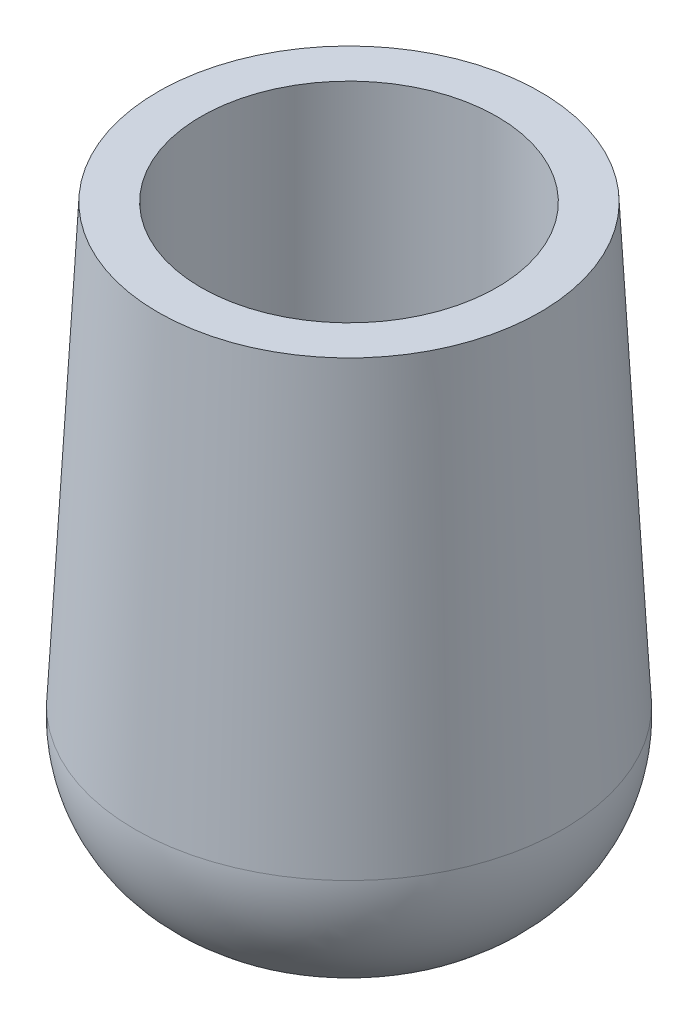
ISO-10303-21;
HEADER;
FILE_DESCRIPTION(('STEP AP214'),'2;1');
FILE_NAME('part.step','',(''),(''),'','','');
FILE_SCHEMA(('AUTOMOTIVE_DESIGN { 1 0 10303 214 1 1 1 1 }'));
ENDSEC;
DATA;
#1=APPLICATION_CONTEXT('core data for automotive mechanical design processes');
#2=APPLICATION_PROTOCOL_DEFINITION('international standard','automotive_design',2000,#1);
#3=PRODUCT_CONTEXT('',#1,'mechanical');
#4=PRODUCT('Part','Part','',(#3));
#5=PRODUCT_RELATED_PRODUCT_CATEGORY('part','',(#4));
#6=PRODUCT_DEFINITION_FORMATION('','',#4);
#7=PRODUCT_DEFINITION_CONTEXT('part definition',#1,'design');
#8=PRODUCT_DEFINITION('design','',#6,#7);
#9=PRODUCT_DEFINITION_SHAPE('','',#8);
#10=(LENGTH_UNIT() NAMED_UNIT(*) SI_UNIT(.MILLI.,.METRE.));
#11=(NAMED_UNIT(*) PLANE_ANGLE_UNIT() SI_UNIT($,.RADIAN.));
#12=(NAMED_UNIT(*) SI_UNIT($,.STERADIAN.) SOLID_ANGLE_UNIT());
#13=UNCERTAINTY_MEASURE_WITH_UNIT(LENGTH_MEASURE(1.E-05),#10,'distance_accuracy_value','');
#14=(GEOMETRIC_REPRESENTATION_CONTEXT(3) GLOBAL_UNCERTAINTY_ASSIGNED_CONTEXT((#13)) GLOBAL_UNIT_ASSIGNED_CONTEXT((#10,
#11,#12)) REPRESENTATION_CONTEXT('',''));
#15=CARTESIAN_POINT('',(0.,0.,0.));
#16=DIRECTION('',(0.,0.,1.));
#17=DIRECTION('',(1.,0.,0.));
#18=AXIS2_PLACEMENT_3D('',#15,#16,#17);
#19=CARTESIAN_POINT('',(0.,0.,0.));
#20=DIRECTION('',(0.,-1.,0.));
#21=DIRECTION('',(0.,0.,1.));
#22=AXIS2_PLACEMENT_3D('',#19,#20,#21);
#23=CONICAL_SURFACE('',#22,4.7625,0.05235987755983);
#24=CARTESIAN_POINT('',(0.,3.34116666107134,0.));
#25=DIRECTION('',(0.,1.,0.));
#26=DIRECTION('',(0.,0.,1.));
#27=AXIS2_PLACEMENT_3D('',#24,#25,#26);
#28=CIRCLE('',#27,4.58739687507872);
#29=CARTESIAN_POINT('',(0.,3.34116666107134,4.58739687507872));
#30=VERTEX_POINT('',#29);
#31=EDGE_CURVE('E32',#30,#30,#28,.T.);
#32=ORIENTED_EDGE('',*,*,#31,.T.);
#33=EDGE_LOOP('',(#32));
#34=FACE_BOUND('',#33,.T.);
#35=CARTESIAN_POINT('',(0.,12.7,0.));
#36=DIRECTION('',(0.,1.,0.));
#37=DIRECTION('',(0.,0.,1.));
#38=AXIS2_PLACEMENT_3D('',#35,#36,#37);
#39=CIRCLE('',#38,4.09692120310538);
#40=CARTESIAN_POINT('',(0.,12.7,4.09692120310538));
#41=VERTEX_POINT('',#40);
#42=EDGE_CURVE('E36',#41,#41,#39,.T.);
#43=ORIENTED_EDGE('',*,*,#42,.F.);
#44=EDGE_LOOP('',(#43));
#45=FACE_BOUND('',#44,.T.);
#46=ADVANCED_FACE('F26',(#34,#45),#23,.T.);
#47=CARTESIAN_POINT('',(0.,12.7,0.));
#48=DIRECTION('',(0.,1.,0.));
#49=DIRECTION('',(0.,0.,1.));
#50=AXIS2_PLACEMENT_3D('',#47,#48,#49);
#51=PLANE('',#50);
#52=CARTESIAN_POINT('',(0.,12.7,0.));
#53=DIRECTION('',(0.,1.,0.));
#54=DIRECTION('',(0.,0.,1.));
#55=AXIS2_PLACEMENT_3D('',#52,#53,#54);
#56=CIRCLE('',#55,3.175);
#57=CARTESIAN_POINT('',(0.,12.7,3.175));
#58=VERTEX_POINT('',#57);
#59=EDGE_CURVE('E45',#58,#58,#56,.T.);
#60=ORIENTED_EDGE('',*,*,#59,.F.);
#61=EDGE_LOOP('',(#60));
#62=FACE_BOUND('',#61,.T.);
#63=ORIENTED_EDGE('',*,*,#42,.T.);
#64=EDGE_LOOP('',(#63));
#65=FACE_BOUND('',#64,.T.);
#66=ADVANCED_FACE('F51',(#62,#65),#51,.T.);
#67=CARTESIAN_POINT('',(0.,0.,0.));
#68=DIRECTION('',(0.,1.,0.));
#69=DIRECTION('',(0.,0.,1.));
#70=AXIS2_PLACEMENT_3D('',#67,#68,#69);
#71=PLANE('',#70);
#72=CARTESIAN_POINT('',(0.,0.,0.));
#73=DIRECTION('',(0.,1.,0.));
#74=DIRECTION('',(0.,0.,1.));
#75=AXIS2_PLACEMENT_3D('',#72,#73,#74);
#76=CIRCLE('',#75,1.41674810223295);
#77=CARTESIAN_POINT('',(0.,0.,1.41674810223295));
#78=VERTEX_POINT('',#77);
#79=EDGE_CURVE('E10',#78,#78,#76,.F.);
#80=ORIENTED_EDGE('',*,*,#79,.T.);
#81=EDGE_LOOP('',(#80));
#82=FACE_BOUND('',#81,.T.);
#83=ADVANCED_FACE('F54',(#82),#71,.F.);
#84=CARTESIAN_POINT('',(0.,3.175,0.));
#85=DIRECTION('',(0.,1.,0.));
#86=DIRECTION('',(0.,0.,1.));
#87=AXIS2_PLACEMENT_3D('',#84,#85,#86);
#88=DEGENERATE_TOROIDAL_SURFACE('',#87,1.41674810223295,3.175,.T.);
#89=ORIENTED_EDGE('',*,*,#79,.F.);
#90=EDGE_LOOP('',(#89));
#91=FACE_BOUND('',#90,.T.);
#92=ORIENTED_EDGE('',*,*,#31,.F.);
#93=EDGE_LOOP('',(#92));
#94=FACE_BOUND('',#93,.T.);
#95=ADVANCED_FACE('F67',(#91,#94),#88,.T.);
#96=CARTESIAN_POINT('',(0.,6.35,0.));
#97=DIRECTION('',(0.,1.,0.));
#98=DIRECTION('',(0.,0.,1.));
#99=AXIS2_PLACEMENT_3D('',#96,#97,#98);
#100=CYLINDRICAL_SURFACE('',#99,3.175);
#101=CARTESIAN_POINT('',(0.,6.35,0.));
#102=DIRECTION('',(0.,1.,0.));
#103=DIRECTION('',(0.,0.,1.));
#104=AXIS2_PLACEMENT_3D('',#101,#102,#103);
#105=CIRCLE('',#104,3.175);
#106=CARTESIAN_POINT('',(0.,6.35,3.175));
#107=VERTEX_POINT('',#106);
#108=EDGE_CURVE('E40',#107,#107,#105,.T.);
#109=ORIENTED_EDGE('',*,*,#108,.F.);
#110=EDGE_LOOP('',(#109));
#111=FACE_BOUND('',#110,.T.);
#112=ORIENTED_EDGE('',*,*,#59,.T.);
#113=EDGE_LOOP('',(#112));
#114=FACE_BOUND('',#113,.T.);
#115=ADVANCED_FACE('F49',(#111,#114),#100,.F.);
#116=CARTESIAN_POINT('',(0.,6.35,0.));
#117=DIRECTION('',(0.,1.,0.));
#118=DIRECTION('',(0.,0.,1.));
#119=AXIS2_PLACEMENT_3D('',#116,#117,#118);
#120=PLANE('',#119);
#121=ORIENTED_EDGE('',*,*,#108,.T.);
#122=EDGE_LOOP('',(#121));
#123=FACE_BOUND('',#122,.T.);
#124=ADVANCED_FACE('F84',(#123),#120,.T.);
#125=CLOSED_SHELL('',(#46,#66,#83,#95,#115,#124));
#126=MANIFOLD_SOLID_BREP('B2',#125);
#127=ADVANCED_BREP_SHAPE_REPRESENTATION('',(#18,#126),#14);
#128=SHAPE_DEFINITION_REPRESENTATION(#9,#127);
ENDSEC;
END-ISO-10303-21;
